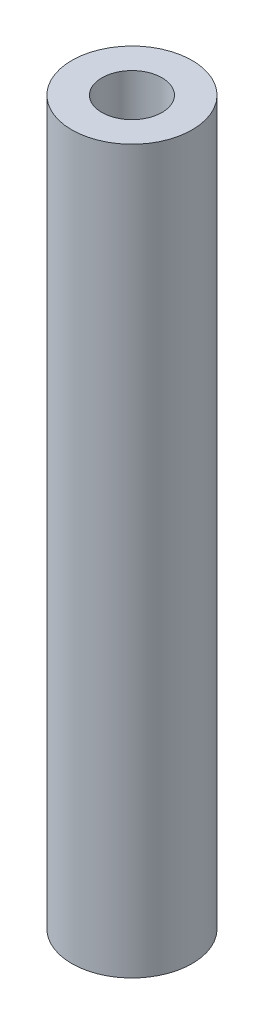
ISO-10303-21;
HEADER;
FILE_DESCRIPTION(('STEP AP214'),'2;1');
FILE_NAME('part.step','',(''),(''),'','','');
FILE_SCHEMA(('AUTOMOTIVE_DESIGN { 1 0 10303 214 1 1 1 1 }'));
ENDSEC;
DATA;
#1=APPLICATION_CONTEXT('core data for automotive mechanical design processes');
#2=APPLICATION_PROTOCOL_DEFINITION('international standard','automotive_design',2000,#1);
#3=PRODUCT_CONTEXT('',#1,'mechanical');
#4=PRODUCT('Part','Part','',(#3));
#5=PRODUCT_RELATED_PRODUCT_CATEGORY('part','',(#4));
#6=PRODUCT_DEFINITION_FORMATION('','',#4);
#7=PRODUCT_DEFINITION_CONTEXT('part definition',#1,'design');
#8=PRODUCT_DEFINITION('design','',#6,#7);
#9=PRODUCT_DEFINITION_SHAPE('','',#8);
#10=(LENGTH_UNIT() NAMED_UNIT(*) SI_UNIT(.MILLI.,.METRE.));
#11=(NAMED_UNIT(*) PLANE_ANGLE_UNIT() SI_UNIT($,.RADIAN.));
#12=(NAMED_UNIT(*) SI_UNIT($,.STERADIAN.) SOLID_ANGLE_UNIT());
#13=UNCERTAINTY_MEASURE_WITH_UNIT(LENGTH_MEASURE(1.E-05),#10,'distance_accuracy_value','');
#14=(GEOMETRIC_REPRESENTATION_CONTEXT(3) GLOBAL_UNCERTAINTY_ASSIGNED_CONTEXT((#13)) GLOBAL_UNIT_ASSIGNED_CONTEXT((#10,
#11,#12)) REPRESENTATION_CONTEXT('',''));
#15=CARTESIAN_POINT('',(0.,0.,0.));
#16=DIRECTION('',(0.,0.,1.));
#17=DIRECTION('',(1.,0.,0.));
#18=AXIS2_PLACEMENT_3D('',#15,#16,#17);
#19=CARTESIAN_POINT('',(0.,60.,0.));
#20=DIRECTION('',(0.,1.,0.));
#21=DIRECTION('',(0.,0.,1.));
#22=AXIS2_PLACEMENT_3D('',#19,#20,#21);
#23=PLANE('',#22);
#24=CARTESIAN_POINT('',(0.,60.,0.));
#25=DIRECTION('',(0.,1.,0.));
#26=DIRECTION('',(0.,0.,1.));
#27=AXIS2_PLACEMENT_3D('',#24,#25,#26);
#28=CIRCLE('',#27,5.);
#29=CARTESIAN_POINT('',(0.,60.,5.));
#30=VERTEX_POINT('',#29);
#31=EDGE_CURVE('E10',#30,#30,#28,.T.);
#32=ORIENTED_EDGE('',*,*,#31,.T.);
#33=EDGE_LOOP('',(#32));
#34=FACE_BOUND('',#33,.T.);
#35=CARTESIAN_POINT('',(0.,60.,0.));
#36=DIRECTION('',(0.,1.,0.));
#37=DIRECTION('',(0.,0.,1.));
#38=AXIS2_PLACEMENT_3D('',#35,#36,#37);
#39=CIRCLE('',#38,2.5);
#40=CARTESIAN_POINT('',(0.,60.,2.5));
#41=VERTEX_POINT('',#40);
#42=EDGE_CURVE('E62',#41,#41,#39,.T.);
#43=ORIENTED_EDGE('',*,*,#42,.F.);
#44=EDGE_LOOP('',(#43));
#45=FACE_BOUND('',#44,.T.);
#46=ADVANCED_FACE('F46',(#34,#45),#23,.T.);
#47=CARTESIAN_POINT('',(0.,0.,0.));
#48=DIRECTION('',(0.,1.,0.));
#49=DIRECTION('',(0.,0.,1.));
#50=AXIS2_PLACEMENT_3D('',#47,#48,#49);
#51=PLANE('',#50);
#52=CARTESIAN_POINT('',(0.,0.,0.));
#53=DIRECTION('',(0.,1.,0.));
#54=DIRECTION('',(0.,0.,1.));
#55=AXIS2_PLACEMENT_3D('',#52,#53,#54);
#56=CIRCLE('',#55,5.);
#57=CARTESIAN_POINT('',(0.,0.,5.));
#58=VERTEX_POINT('',#57);
#59=EDGE_CURVE('E50',#58,#58,#56,.T.);
#60=ORIENTED_EDGE('',*,*,#59,.F.);
#61=EDGE_LOOP('',(#60));
#62=FACE_BOUND('',#61,.T.);
#63=CARTESIAN_POINT('',(0.,0.,0.));
#64=DIRECTION('',(0.,1.,0.));
#65=DIRECTION('',(0.,0.,1.));
#66=AXIS2_PLACEMENT_3D('',#63,#64,#65);
#67=CIRCLE('',#66,2.5);
#68=CARTESIAN_POINT('',(0.,0.,2.5));
#69=VERTEX_POINT('',#68);
#70=EDGE_CURVE('E64',#69,#69,#67,.T.);
#71=ORIENTED_EDGE('',*,*,#70,.T.);
#72=EDGE_LOOP('',(#71));
#73=FACE_BOUND('',#72,.T.);
#74=ADVANCED_FACE('F75',(#62,#73),#51,.F.);
#75=CARTESIAN_POINT('',(0.,60.,0.));
#76=DIRECTION('',(0.,-1.,0.));
#77=DIRECTION('',(0.,0.,-1.));
#78=AXIS2_PLACEMENT_3D('',#75,#76,#77);
#79=CYLINDRICAL_SURFACE('',#78,5.);
#80=ORIENTED_EDGE('',*,*,#31,.F.);
#81=EDGE_LOOP('',(#80));
#82=FACE_BOUND('',#81,.T.);
#83=ORIENTED_EDGE('',*,*,#59,.T.);
#84=EDGE_LOOP('',(#83));
#85=FACE_BOUND('',#84,.T.);
#86=ADVANCED_FACE('F48',(#82,#85),#79,.T.);
#87=CARTESIAN_POINT('',(0.,60.,0.));
#88=DIRECTION('',(0.,-1.,0.));
#89=DIRECTION('',(0.,0.,-1.));
#90=AXIS2_PLACEMENT_3D('',#87,#88,#89);
#91=CYLINDRICAL_SURFACE('',#90,2.5);
#92=ORIENTED_EDGE('',*,*,#42,.T.);
#93=EDGE_LOOP('',(#92));
#94=FACE_BOUND('',#93,.T.);
#95=ORIENTED_EDGE('',*,*,#70,.F.);
#96=EDGE_LOOP('',(#95));
#97=FACE_BOUND('',#96,.T.);
#98=ADVANCED_FACE('F71',(#94,#97),#91,.F.);
#99=CLOSED_SHELL('',(#46,#74,#86,#98));
#100=MANIFOLD_SOLID_BREP('B2',#99);
#101=ADVANCED_BREP_SHAPE_REPRESENTATION('',(#18,#100),#14);
#102=SHAPE_DEFINITION_REPRESENTATION(#9,#101);
ENDSEC;
END-ISO-10303-21;
